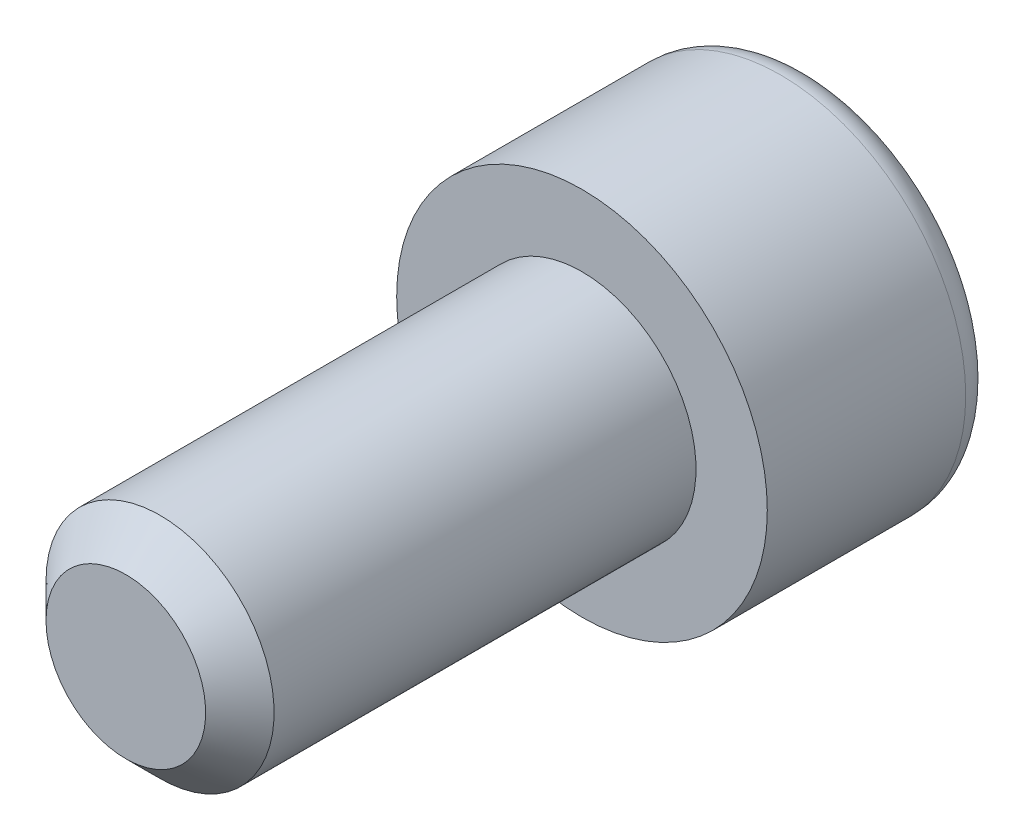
from build123d import *

# Parameters (mm, degrees)
ESQUISSE1_R     = 4
CORPS_DEPTH     = 16
ESQUISSE2_R     = 6.5
TETE_DEPTH      = 8
F_6PANS_DEPTH   = 5.6
CHANFREIN2_SIZE = 1.2
CONG_1_R        = 1.04


with BuildPart() as part:
    # Esquisse1 → Corps (new body)
    with BuildSketch(Plane.XY):
        Circle(ESQUISSE1_R)
    extrude(amount=CORPS_DEPTH)

    # Esquisse2 → Tete (add)
    with BuildSketch(Plane.XY):
        Circle(ESQUISSE2_R)
    extrude(amount=-TETE_DEPTH)

    # Esquisse3 → 6pans (cut)
    with BuildSketch(Plane.XY.offset(-8)):
        Polygon((0, -3.464101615), (3, -1.732050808), (3, 1.732050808), (0, 3.464101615), (-3, 1.732050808), (-3, -1.732050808), align=None)
    extrude(amount=F_6PANS_DEPTH, mode=Mode.SUBTRACT)

    # Chanfrein2
    chanfrein2_edges = [part.edges().sort_by_distance(p)[0] for p in [
        (-4, 0, 16),
    ]]
    chamfer(chanfrein2_edges, length=CHANFREIN2_SIZE)

    # Cong_1
    cong_1_edges = [part.edges().sort_by_distance(p)[0] for p in [
        (-6.5, 0, -8),
    ]]
    fillet(cong_1_edges, radius=CONG_1_R)


solid = part.part
